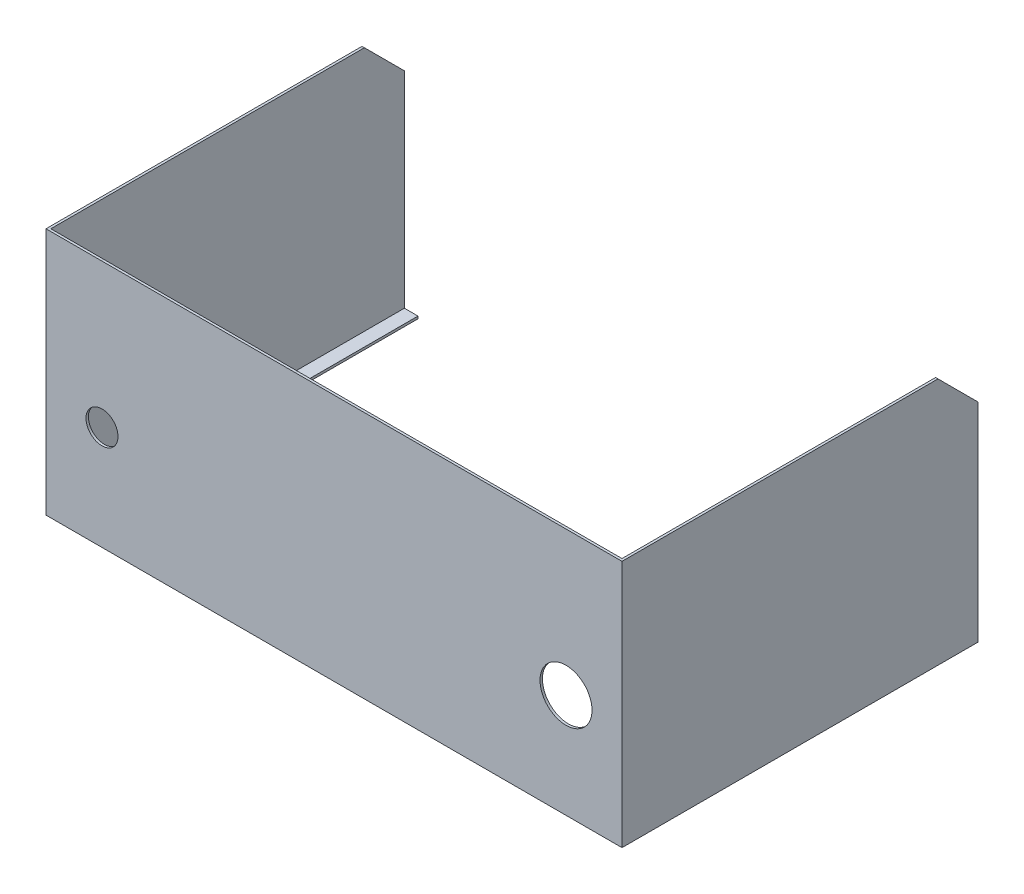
ISO-10303-21;
HEADER;
FILE_DESCRIPTION(('STEP AP214'),'2;1');
FILE_NAME('part.step','',(''),(''),'','','');
FILE_SCHEMA(('AUTOMOTIVE_DESIGN { 1 0 10303 214 1 1 1 1 }'));
ENDSEC;
DATA;
#1=APPLICATION_CONTEXT('core data for automotive mechanical design processes');
#2=APPLICATION_PROTOCOL_DEFINITION('international standard','automotive_design',2000,#1);
#3=PRODUCT_CONTEXT('',#1,'mechanical');
#4=PRODUCT('Part','Part','',(#3));
#5=PRODUCT_RELATED_PRODUCT_CATEGORY('part','',(#4));
#6=PRODUCT_DEFINITION_FORMATION('','',#4);
#7=PRODUCT_DEFINITION_CONTEXT('part definition',#1,'design');
#8=PRODUCT_DEFINITION('design','',#6,#7);
#9=PRODUCT_DEFINITION_SHAPE('','',#8);
#10=(LENGTH_UNIT() NAMED_UNIT(*) SI_UNIT(.MILLI.,.METRE.));
#11=(NAMED_UNIT(*) PLANE_ANGLE_UNIT() SI_UNIT($,.RADIAN.));
#12=(NAMED_UNIT(*) SI_UNIT($,.STERADIAN.) SOLID_ANGLE_UNIT());
#13=UNCERTAINTY_MEASURE_WITH_UNIT(LENGTH_MEASURE(1.E-05),#10,'distance_accuracy_value','');
#14=(GEOMETRIC_REPRESENTATION_CONTEXT(3) GLOBAL_UNCERTAINTY_ASSIGNED_CONTEXT((#13)) GLOBAL_UNIT_ASSIGNED_CONTEXT((#10,
#11,#12)) REPRESENTATION_CONTEXT('',''));
#15=CARTESIAN_POINT('',(0.,0.,0.));
#16=DIRECTION('',(0.,0.,1.));
#17=DIRECTION('',(1.,0.,0.));
#18=AXIS2_PLACEMENT_3D('',#15,#16,#17);
#19=CARTESIAN_POINT('',(0.,0.,0.));
#20=DIRECTION('',(0.,0.,-1.));
#21=DIRECTION('',(-1.,0.,0.));
#22=AXIS2_PLACEMENT_3D('',#19,#20,#21);
#23=PLANE('',#22);
#24=CARTESIAN_POINT('',(-290.,-25.,0.));
#25=DIRECTION('',(0.,0.,1.));
#26=DIRECTION('',(1.,0.,0.));
#27=AXIS2_PLACEMENT_3D('',#24,#25,#26);
#28=CIRCLE('',#27,20.);
#29=CARTESIAN_POINT('',(-270.,-25.,0.));
#30=VERTEX_POINT('',#29);
#31=EDGE_CURVE('E236',#30,#30,#28,.T.);
#32=ORIENTED_EDGE('',*,*,#31,.T.);
#33=EDGE_LOOP('',(#32));
#34=FACE_BOUND('',#33,.T.);
#35=CARTESIAN_POINT('',(290.,-24.9999999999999,0.));
#36=DIRECTION('',(0.,0.,1.));
#37=DIRECTION('',(1.,0.,0.));
#38=AXIS2_PLACEMENT_3D('',#35,#36,#37);
#39=CIRCLE('',#38,32.5);
#40=CARTESIAN_POINT('',(322.5,-24.9999999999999,0.));
#41=VERTEX_POINT('',#40);
#42=EDGE_CURVE('E228',#41,#41,#39,.T.);
#43=ORIENTED_EDGE('',*,*,#42,.T.);
#44=EDGE_LOOP('',(#43));
#45=FACE_BOUND('',#44,.T.);
#46=DIRECTION('',(0.,-1.,0.));
#47=VECTOR('',#46,1.);
#48=CARTESIAN_POINT('',(357.,-155.,0.));
#49=LINE('',#48,#47);
#50=CARTESIAN_POINT('',(357.,155.,0.));
#51=VERTEX_POINT('',#50);
#52=CARTESIAN_POINT('',(357.,-152.,0.));
#53=VERTEX_POINT('',#52);
#54=EDGE_CURVE('E217',#51,#53,#49,.T.);
#55=ORIENTED_EDGE('',*,*,#54,.T.);
#56=DIRECTION('',(1.,0.,0.));
#57=VECTOR('',#56,1.);
#58=CARTESIAN_POINT('',(0.,-152.,0.));
#59=LINE('',#58,#57);
#60=CARTESIAN_POINT('',(-357.,-152.,0.));
#61=VERTEX_POINT('',#60);
#62=EDGE_CURVE('E170',#61,#53,#59,.T.);
#63=ORIENTED_EDGE('',*,*,#62,.F.);
#64=DIRECTION('',(0.,1.,0.));
#65=VECTOR('',#64,1.);
#66=CARTESIAN_POINT('',(-357.,-155.,0.));
#67=LINE('',#66,#65);
#68=CARTESIAN_POINT('',(-357.,155.,0.));
#69=VERTEX_POINT('',#68);
#70=EDGE_CURVE('E187',#61,#69,#67,.T.);
#71=ORIENTED_EDGE('',*,*,#70,.T.);
#72=DIRECTION('',(-1.,0.,0.));
#73=VECTOR('',#72,1.);
#74=CARTESIAN_POINT('',(360.,155.,0.));
#75=LINE('',#74,#73);
#76=EDGE_CURVE('E242',#51,#69,#75,.T.);
#77=ORIENTED_EDGE('',*,*,#76,.F.);
#78=EDGE_LOOP('',(#55,#63,#71,#77));
#79=FACE_BOUND('',#78,.T.);
#80=ADVANCED_FACE('F35',(#34,#45,#79),#23,.T.);
#81=CARTESIAN_POINT('',(357.,0.,0.));
#82=DIRECTION('',(1.,0.,0.));
#83=DIRECTION('',(0.,0.,-1.));
#84=AXIS2_PLACEMENT_3D('',#81,#82,#83);
#85=PLANE('',#84);
#86=DIRECTION('',(0.,0.,-1.));
#87=VECTOR('',#86,1.);
#88=CARTESIAN_POINT('',(357.,-152.,0.));
#89=LINE('',#88,#87);
#90=CARTESIAN_POINT('',(357.,-152.,-442.));
#91=VERTEX_POINT('',#90);
#92=EDGE_CURVE('E168',#53,#91,#89,.T.);
#93=ORIENTED_EDGE('',*,*,#92,.F.);
#94=ORIENTED_EDGE('',*,*,#54,.F.);
#95=DIRECTION('',(0.,0.,1.));
#96=VECTOR('',#95,1.);
#97=CARTESIAN_POINT('',(357.,155.,0.));
#98=LINE('',#97,#96);
#99=CARTESIAN_POINT('',(357.,155.,-392.));
#100=VERTEX_POINT('',#99);
#101=EDGE_CURVE('E215',#100,#51,#98,.T.);
#102=ORIENTED_EDGE('',*,*,#101,.F.);
#103=DIRECTION('',(0.,0.707106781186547,0.707106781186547));
#104=VECTOR('',#103,1.);
#105=CARTESIAN_POINT('',(357.,155.,-392.));
#106=LINE('',#105,#104);
#107=CARTESIAN_POINT('',(357.,105.,-442.));
#108=VERTEX_POINT('',#107);
#109=EDGE_CURVE('E211',#108,#100,#106,.T.);
#110=ORIENTED_EDGE('',*,*,#109,.F.);
#111=DIRECTION('',(0.,1.,0.));
#112=VECTOR('',#111,1.);
#113=CARTESIAN_POINT('',(357.,-155.,-442.));
#114=LINE('',#113,#112);
#115=EDGE_CURVE('E209',#91,#108,#114,.T.);
#116=ORIENTED_EDGE('',*,*,#115,.F.);
#117=EDGE_LOOP('',(#93,#94,#102,#110,#116));
#118=FACE_BOUND('',#117,.T.);
#119=ADVANCED_FACE('F300',(#118),#85,.F.);
#120=CARTESIAN_POINT('',(-357.,0.,0.));
#121=DIRECTION('',(-1.,0.,0.));
#122=DIRECTION('',(0.,0.,1.));
#123=AXIS2_PLACEMENT_3D('',#120,#121,#122);
#124=PLANE('',#123);
#125=DIRECTION('',(0.,0.,1.));
#126=VECTOR('',#125,1.);
#127=CARTESIAN_POINT('',(-357.,-152.,0.));
#128=LINE('',#127,#126);
#129=CARTESIAN_POINT('',(-357.,-152.,-442.));
#130=VERTEX_POINT('',#129);
#131=EDGE_CURVE('E172',#130,#61,#128,.T.);
#132=ORIENTED_EDGE('',*,*,#131,.F.);
#133=DIRECTION('',(0.,-1.,0.));
#134=VECTOR('',#133,1.);
#135=CARTESIAN_POINT('',(-357.,105.,-442.));
#136=LINE('',#135,#134);
#137=CARTESIAN_POINT('',(-357.,105.,-442.));
#138=VERTEX_POINT('',#137);
#139=EDGE_CURVE('E184',#138,#130,#136,.T.);
#140=ORIENTED_EDGE('',*,*,#139,.F.);
#141=DIRECTION('',(0.,-0.707106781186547,-0.707106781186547));
#142=VECTOR('',#141,1.);
#143=CARTESIAN_POINT('',(-357.,155.,-392.));
#144=LINE('',#143,#142);
#145=CARTESIAN_POINT('',(-357.,155.,-392.));
#146=VERTEX_POINT('',#145);
#147=EDGE_CURVE('E193',#146,#138,#144,.T.);
#148=ORIENTED_EDGE('',*,*,#147,.F.);
#149=DIRECTION('',(0.,0.,-1.));
#150=VECTOR('',#149,1.);
#151=CARTESIAN_POINT('',(-357.,155.,0.));
#152=LINE('',#151,#150);
#153=EDGE_CURVE('E190',#69,#146,#152,.T.);
#154=ORIENTED_EDGE('',*,*,#153,.F.);
#155=ORIENTED_EDGE('',*,*,#70,.F.);
#156=EDGE_LOOP('',(#132,#140,#148,#154,#155));
#157=FACE_BOUND('',#156,.T.);
#158=ADVANCED_FACE('F290',(#157),#124,.F.);
#159=CARTESIAN_POINT('',(0.,0.,3.));
#160=DIRECTION('',(0.,0.,-1.));
#161=DIRECTION('',(-1.,0.,0.));
#162=AXIS2_PLACEMENT_3D('',#159,#160,#161);
#163=PLANE('',#162);
#164=DIRECTION('',(0.,-1.,0.));
#165=VECTOR('',#164,1.);
#166=CARTESIAN_POINT('',(-360.,155.,3.));
#167=LINE('',#166,#165);
#168=CARTESIAN_POINT('',(-360.,155.,3.));
#169=VERTEX_POINT('',#168);
#170=CARTESIAN_POINT('',(-360.,-155.,3.));
#171=VERTEX_POINT('',#170);
#172=EDGE_CURVE('E245',#169,#171,#167,.T.);
#173=ORIENTED_EDGE('',*,*,#172,.T.);
#174=DIRECTION('',(1.,0.,0.));
#175=VECTOR('',#174,1.);
#176=CARTESIAN_POINT('',(360.,-155.,3.));
#177=LINE('',#176,#175);
#178=CARTESIAN_POINT('',(360.,-155.,3.));
#179=VERTEX_POINT('',#178);
#180=EDGE_CURVE('E247',#171,#179,#177,.T.);
#181=ORIENTED_EDGE('',*,*,#180,.T.);
#182=DIRECTION('',(0.,1.,0.));
#183=VECTOR('',#182,1.);
#184=CARTESIAN_POINT('',(360.,155.,3.));
#185=LINE('',#184,#183);
#186=CARTESIAN_POINT('',(360.,155.,3.));
#187=VERTEX_POINT('',#186);
#188=EDGE_CURVE('E55',#179,#187,#185,.T.);
#189=ORIENTED_EDGE('',*,*,#188,.T.);
#190=DIRECTION('',(-1.,0.,0.));
#191=VECTOR('',#190,1.);
#192=CARTESIAN_POINT('',(360.,155.,3.));
#193=LINE('',#192,#191);
#194=EDGE_CURVE('E50',#187,#169,#193,.T.);
#195=ORIENTED_EDGE('',*,*,#194,.T.);
#196=EDGE_LOOP('',(#173,#181,#189,#195));
#197=FACE_BOUND('',#196,.T.);
#198=CARTESIAN_POINT('',(-290.,-25.,3.));
#199=DIRECTION('',(0.,0.,1.));
#200=DIRECTION('',(1.,0.,0.));
#201=AXIS2_PLACEMENT_3D('',#198,#199,#200);
#202=CIRCLE('',#201,20.);
#203=CARTESIAN_POINT('',(-270.,-25.,3.));
#204=VERTEX_POINT('',#203);
#205=EDGE_CURVE('E239',#204,#204,#202,.T.);
#206=ORIENTED_EDGE('',*,*,#205,.F.);
#207=EDGE_LOOP('',(#206));
#208=FACE_BOUND('',#207,.T.);
#209=CARTESIAN_POINT('',(290.,-24.9999999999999,3.));
#210=DIRECTION('',(0.,0.,1.));
#211=DIRECTION('',(1.,0.,0.));
#212=AXIS2_PLACEMENT_3D('',#209,#210,#211);
#213=CIRCLE('',#212,32.5);
#214=CARTESIAN_POINT('',(322.5,-24.9999999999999,3.));
#215=VERTEX_POINT('',#214);
#216=EDGE_CURVE('E233',#215,#215,#213,.T.);
#217=ORIENTED_EDGE('',*,*,#216,.F.);
#218=EDGE_LOOP('',(#217));
#219=FACE_BOUND('',#218,.T.);
#220=ADVANCED_FACE('F279',(#197,#208,#219),#163,.F.);
#221=CARTESIAN_POINT('',(-360.,155.,3.));
#222=DIRECTION('',(1.,0.,0.));
#223=DIRECTION('',(0.,0.,-1.));
#224=AXIS2_PLACEMENT_3D('',#221,#222,#223);
#225=PLANE('',#224);
#226=DIRECTION('',(0.,0.,-1.));
#227=VECTOR('',#226,1.);
#228=CARTESIAN_POINT('',(-360.,155.,3.));
#229=LINE('',#228,#227);
#230=CARTESIAN_POINT('',(-360.,155.,-392.));
#231=VERTEX_POINT('',#230);
#232=EDGE_CURVE('E251',#169,#231,#229,.T.);
#233=ORIENTED_EDGE('',*,*,#232,.T.);
#234=DIRECTION('',(0.,-0.707106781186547,-0.707106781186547));
#235=VECTOR('',#234,1.);
#236=CARTESIAN_POINT('',(-360.,155.,-392.));
#237=LINE('',#236,#235);
#238=CARTESIAN_POINT('',(-360.,105.,-442.));
#239=VERTEX_POINT('',#238);
#240=EDGE_CURVE('E188',#231,#239,#237,.T.);
#241=ORIENTED_EDGE('',*,*,#240,.T.);
#242=DIRECTION('',(0.,-1.,0.));
#243=VECTOR('',#242,1.);
#244=CARTESIAN_POINT('',(-360.,105.,-442.));
#245=LINE('',#244,#243);
#246=CARTESIAN_POINT('',(-360.,-155.,-442.));
#247=VERTEX_POINT('',#246);
#248=EDGE_CURVE('E179',#239,#247,#245,.T.);
#249=ORIENTED_EDGE('',*,*,#248,.T.);
#250=DIRECTION('',(0.,0.,-1.));
#251=VECTOR('',#250,1.);
#252=CARTESIAN_POINT('',(-360.,-155.,3.));
#253=LINE('',#252,#251);
#254=EDGE_CURVE('E11',#171,#247,#253,.T.);
#255=ORIENTED_EDGE('',*,*,#254,.F.);
#256=ORIENTED_EDGE('',*,*,#172,.F.);
#257=EDGE_LOOP('',(#233,#241,#249,#255,#256));
#258=FACE_BOUND('',#257,.T.);
#259=ADVANCED_FACE('F37',(#258),#225,.F.);
#260=CARTESIAN_POINT('',(360.,-155.,3.));
#261=DIRECTION('',(0.,1.,0.));
#262=DIRECTION('',(-1.,0.,0.));
#263=AXIS2_PLACEMENT_3D('',#260,#261,#262);
#264=PLANE('',#263);
#265=DIRECTION('',(0.,0.,1.));
#266=VECTOR('',#265,1.);
#267=CARTESIAN_POINT('',(340.,-155.,0.));
#268=LINE('',#267,#266);
#269=CARTESIAN_POINT('',(340.,-155.,-442.));
#270=VERTEX_POINT('',#269);
#271=CARTESIAN_POINT('',(340.,-155.,-17.));
#272=VERTEX_POINT('',#271);
#273=EDGE_CURVE('E160',#270,#272,#268,.T.);
#274=ORIENTED_EDGE('',*,*,#273,.F.);
#275=DIRECTION('',(1.,0.,0.));
#276=VECTOR('',#275,1.);
#277=CARTESIAN_POINT('',(357.,-155.,-442.));
#278=LINE('',#277,#276);
#279=CARTESIAN_POINT('',(360.,-155.,-442.));
#280=VERTEX_POINT('',#279);
#281=EDGE_CURVE('E220',#270,#280,#278,.T.);
#282=ORIENTED_EDGE('',*,*,#281,.T.);
#283=DIRECTION('',(0.,0.,-1.));
#284=VECTOR('',#283,1.);
#285=CARTESIAN_POINT('',(360.,-155.,3.));
#286=LINE('',#285,#284);
#287=EDGE_CURVE('E43',#179,#280,#286,.T.);
#288=ORIENTED_EDGE('',*,*,#287,.F.);
#289=ORIENTED_EDGE('',*,*,#180,.F.);
#290=ORIENTED_EDGE('',*,*,#254,.T.);
#291=DIRECTION('',(-1.,0.,0.));
#292=VECTOR('',#291,1.);
#293=CARTESIAN_POINT('',(-357.,-155.,-442.));
#294=LINE('',#293,#292);
#295=CARTESIAN_POINT('',(-340.,-155.,-442.));
#296=VERTEX_POINT('',#295);
#297=EDGE_CURVE('E196',#296,#247,#294,.T.);
#298=ORIENTED_EDGE('',*,*,#297,.F.);
#299=DIRECTION('',(0.,0.,1.));
#300=VECTOR('',#299,1.);
#301=CARTESIAN_POINT('',(-340.,-155.,0.));
#302=LINE('',#301,#300);
#303=CARTESIAN_POINT('',(-340.,-155.,-17.));
#304=VERTEX_POINT('',#303);
#305=EDGE_CURVE('E175',#296,#304,#302,.T.);
#306=ORIENTED_EDGE('',*,*,#305,.T.);
#307=DIRECTION('',(1.,0.,0.));
#308=VECTOR('',#307,1.);
#309=CARTESIAN_POINT('',(0.,-155.,-17.));
#310=LINE('',#309,#308);
#311=EDGE_CURVE('E140',#304,#272,#310,.T.);
#312=ORIENTED_EDGE('',*,*,#311,.T.);
#313=EDGE_LOOP('',(#274,#282,#288,#289,#290,#298,#306,#312));
#314=FACE_BOUND('',#313,.T.);
#315=ADVANCED_FACE('F262',(#314),#264,.F.);
#316=CARTESIAN_POINT('',(360.,155.,3.));
#317=DIRECTION('',(-1.,0.,0.));
#318=DIRECTION('',(0.,0.,1.));
#319=AXIS2_PLACEMENT_3D('',#316,#317,#318);
#320=PLANE('',#319);
#321=ORIENTED_EDGE('',*,*,#287,.T.);
#322=DIRECTION('',(0.,1.,0.));
#323=VECTOR('',#322,1.);
#324=CARTESIAN_POINT('',(360.,-155.,-442.));
#325=LINE('',#324,#323);
#326=CARTESIAN_POINT('',(360.,105.,-442.));
#327=VERTEX_POINT('',#326);
#328=EDGE_CURVE('E203',#280,#327,#325,.T.);
#329=ORIENTED_EDGE('',*,*,#328,.T.);
#330=DIRECTION('',(0.,0.707106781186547,0.707106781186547));
#331=VECTOR('',#330,1.);
#332=CARTESIAN_POINT('',(360.,155.,-392.));
#333=LINE('',#332,#331);
#334=CARTESIAN_POINT('',(360.,155.,-392.));
#335=VERTEX_POINT('',#334);
#336=EDGE_CURVE('E212',#327,#335,#333,.T.);
#337=ORIENTED_EDGE('',*,*,#336,.T.);
#338=DIRECTION('',(0.,0.,-1.));
#339=VECTOR('',#338,1.);
#340=CARTESIAN_POINT('',(360.,155.,3.));
#341=LINE('',#340,#339);
#342=EDGE_CURVE('E255',#187,#335,#341,.T.);
#343=ORIENTED_EDGE('',*,*,#342,.F.);
#344=ORIENTED_EDGE('',*,*,#188,.F.);
#345=EDGE_LOOP('',(#321,#329,#337,#343,#344));
#346=FACE_BOUND('',#345,.T.);
#347=ADVANCED_FACE('F258',(#346),#320,.F.);
#348=CARTESIAN_POINT('',(360.,155.,3.));
#349=DIRECTION('',(0.,-1.,0.));
#350=DIRECTION('',(1.,0.,0.));
#351=AXIS2_PLACEMENT_3D('',#348,#349,#350);
#352=PLANE('',#351);
#353=ORIENTED_EDGE('',*,*,#342,.T.);
#354=DIRECTION('',(1.,0.,0.));
#355=VECTOR('',#354,1.);
#356=CARTESIAN_POINT('',(357.,155.,-392.));
#357=LINE('',#356,#355);
#358=EDGE_CURVE('E225',#100,#335,#357,.T.);
#359=ORIENTED_EDGE('',*,*,#358,.F.);
#360=ORIENTED_EDGE('',*,*,#101,.T.);
#361=ORIENTED_EDGE('',*,*,#76,.T.);
#362=ORIENTED_EDGE('',*,*,#153,.T.);
#363=DIRECTION('',(-1.,0.,0.));
#364=VECTOR('',#363,1.);
#365=CARTESIAN_POINT('',(-357.,155.,-392.));
#366=LINE('',#365,#364);
#367=EDGE_CURVE('E204',#146,#231,#366,.T.);
#368=ORIENTED_EDGE('',*,*,#367,.T.);
#369=ORIENTED_EDGE('',*,*,#232,.F.);
#370=ORIENTED_EDGE('',*,*,#194,.F.);
#371=EDGE_LOOP('',(#353,#359,#360,#361,#362,#368,#369,#370));
#372=FACE_BOUND('',#371,.T.);
#373=ADVANCED_FACE('F274',(#372),#352,.F.);
#374=CARTESIAN_POINT('',(-290.,-25.,3.));
#375=DIRECTION('',(0.,0.,-1.));
#376=DIRECTION('',(-1.,0.,0.));
#377=AXIS2_PLACEMENT_3D('',#374,#375,#376);
#378=CYLINDRICAL_SURFACE('',#377,20.);
#379=ORIENTED_EDGE('',*,*,#205,.T.);
#380=EDGE_LOOP('',(#379));
#381=FACE_BOUND('',#380,.T.);
#382=ORIENTED_EDGE('',*,*,#31,.F.);
#383=EDGE_LOOP('',(#382));
#384=FACE_BOUND('',#383,.T.);
#385=ADVANCED_FACE('F325',(#381,#384),#378,.F.);
#386=CARTESIAN_POINT('',(290.,-24.9999999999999,3.));
#387=DIRECTION('',(0.,0.,-1.));
#388=DIRECTION('',(-1.,0.,0.));
#389=AXIS2_PLACEMENT_3D('',#386,#387,#388);
#390=CYLINDRICAL_SURFACE('',#389,32.5);
#391=ORIENTED_EDGE('',*,*,#216,.T.);
#392=EDGE_LOOP('',(#391));
#393=FACE_BOUND('',#392,.T.);
#394=ORIENTED_EDGE('',*,*,#42,.F.);
#395=EDGE_LOOP('',(#394));
#396=FACE_BOUND('',#395,.T.);
#397=ADVANCED_FACE('F347',(#393,#396),#390,.F.);
#398=CARTESIAN_POINT('',(357.,155.,-392.));
#399=DIRECTION('',(0.,0.707106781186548,-0.707106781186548));
#400=DIRECTION('',(0.,0.707106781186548,0.707106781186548));
#401=AXIS2_PLACEMENT_3D('',#398,#399,#400);
#402=PLANE('',#401);
#403=ORIENTED_EDGE('',*,*,#336,.F.);
#404=DIRECTION('',(1.,0.,0.));
#405=VECTOR('',#404,1.);
#406=CARTESIAN_POINT('',(357.,105.,-442.));
#407=LINE('',#406,#405);
#408=EDGE_CURVE('E229',#108,#327,#407,.T.);
#409=ORIENTED_EDGE('',*,*,#408,.F.);
#410=ORIENTED_EDGE('',*,*,#109,.T.);
#411=ORIENTED_EDGE('',*,*,#358,.T.);
#412=EDGE_LOOP('',(#403,#409,#410,#411));
#413=FACE_BOUND('',#412,.T.);
#414=ADVANCED_FACE('F272',(#413),#402,.T.);
#415=CARTESIAN_POINT('',(357.,-155.,-442.));
#416=DIRECTION('',(0.,0.,-1.));
#417=DIRECTION('',(-1.,0.,0.));
#418=AXIS2_PLACEMENT_3D('',#415,#416,#417);
#419=PLANE('',#418);
#420=ORIENTED_EDGE('',*,*,#328,.F.);
#421=ORIENTED_EDGE('',*,*,#281,.F.);
#422=DIRECTION('',(0.,-1.,0.));
#423=VECTOR('',#422,1.);
#424=CARTESIAN_POINT('',(340.,-152.,-442.));
#425=LINE('',#424,#423);
#426=CARTESIAN_POINT('',(340.,-152.,-442.));
#427=VERTEX_POINT('',#426);
#428=EDGE_CURVE('E180',#427,#270,#425,.T.);
#429=ORIENTED_EDGE('',*,*,#428,.F.);
#430=DIRECTION('',(-1.,0.,0.));
#431=VECTOR('',#430,1.);
#432=CARTESIAN_POINT('',(0.,-152.,-442.));
#433=LINE('',#432,#431);
#434=EDGE_CURVE('E166',#91,#427,#433,.T.);
#435=ORIENTED_EDGE('',*,*,#434,.F.);
#436=ORIENTED_EDGE('',*,*,#115,.T.);
#437=ORIENTED_EDGE('',*,*,#408,.T.);
#438=EDGE_LOOP('',(#420,#421,#429,#435,#436,#437));
#439=FACE_BOUND('',#438,.T.);
#440=ADVANCED_FACE('F265',(#439),#419,.T.);
#441=CARTESIAN_POINT('',(-357.,105.,-442.));
#442=DIRECTION('',(0.,0.,-1.));
#443=DIRECTION('',(-1.,0.,0.));
#444=AXIS2_PLACEMENT_3D('',#441,#442,#443);
#445=PLANE('',#444);
#446=ORIENTED_EDGE('',*,*,#248,.F.);
#447=DIRECTION('',(-1.,0.,0.));
#448=VECTOR('',#447,1.);
#449=CARTESIAN_POINT('',(-357.,105.,-442.));
#450=LINE('',#449,#448);
#451=EDGE_CURVE('E201',#138,#239,#450,.T.);
#452=ORIENTED_EDGE('',*,*,#451,.F.);
#453=ORIENTED_EDGE('',*,*,#139,.T.);
#454=DIRECTION('',(1.,0.,0.));
#455=VECTOR('',#454,1.);
#456=CARTESIAN_POINT('',(0.,-152.,-442.));
#457=LINE('',#456,#455);
#458=CARTESIAN_POINT('',(-340.,-152.,-442.));
#459=VERTEX_POINT('',#458);
#460=EDGE_CURVE('E146',#130,#459,#457,.T.);
#461=ORIENTED_EDGE('',*,*,#460,.T.);
#462=DIRECTION('',(0.,-1.,0.));
#463=VECTOR('',#462,1.);
#464=CARTESIAN_POINT('',(-340.,-152.,-442.));
#465=LINE('',#464,#463);
#466=EDGE_CURVE('E159',#459,#296,#465,.T.);
#467=ORIENTED_EDGE('',*,*,#466,.T.);
#468=ORIENTED_EDGE('',*,*,#297,.T.);
#469=EDGE_LOOP('',(#446,#452,#453,#461,#467,#468));
#470=FACE_BOUND('',#469,.T.);
#471=ADVANCED_FACE('F283',(#470),#445,.T.);
#472=CARTESIAN_POINT('',(-357.,155.,-392.));
#473=DIRECTION('',(0.,0.707106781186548,-0.707106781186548));
#474=DIRECTION('',(0.,0.707106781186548,0.707106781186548));
#475=AXIS2_PLACEMENT_3D('',#472,#473,#474);
#476=PLANE('',#475);
#477=ORIENTED_EDGE('',*,*,#240,.F.);
#478=ORIENTED_EDGE('',*,*,#367,.F.);
#479=ORIENTED_EDGE('',*,*,#147,.T.);
#480=ORIENTED_EDGE('',*,*,#451,.T.);
#481=EDGE_LOOP('',(#477,#478,#479,#480));
#482=FACE_BOUND('',#481,.T.);
#483=ADVANCED_FACE('F285',(#482),#476,.T.);
#484=CARTESIAN_POINT('',(-340.,-152.,0.));
#485=DIRECTION('',(1.,0.,0.));
#486=DIRECTION('',(0.,1.,0.));
#487=AXIS2_PLACEMENT_3D('',#484,#485,#486);
#488=PLANE('',#487);
#489=ORIENTED_EDGE('',*,*,#305,.F.);
#490=ORIENTED_EDGE('',*,*,#466,.F.);
#491=DIRECTION('',(0.,0.,1.));
#492=VECTOR('',#491,1.);
#493=CARTESIAN_POINT('',(-340.,-152.,0.));
#494=LINE('',#493,#492);
#495=CARTESIAN_POINT('',(-340.,-152.,-17.));
#496=VERTEX_POINT('',#495);
#497=EDGE_CURVE('E151',#459,#496,#494,.T.);
#498=ORIENTED_EDGE('',*,*,#497,.T.);
#499=DIRECTION('',(0.,-1.,0.));
#500=VECTOR('',#499,1.);
#501=CARTESIAN_POINT('',(-340.,-152.,-17.));
#502=LINE('',#501,#500);
#503=EDGE_CURVE('E135',#496,#304,#502,.T.);
#504=ORIENTED_EDGE('',*,*,#503,.T.);
#505=EDGE_LOOP('',(#489,#490,#498,#504));
#506=FACE_BOUND('',#505,.T.);
#507=ADVANCED_FACE('F157',(#506),#488,.T.);
#508=CARTESIAN_POINT('',(340.,-152.,0.));
#509=DIRECTION('',(1.,0.,0.));
#510=DIRECTION('',(0.,1.,0.));
#511=AXIS2_PLACEMENT_3D('',#508,#509,#510);
#512=PLANE('',#511);
#513=ORIENTED_EDGE('',*,*,#273,.T.);
#514=DIRECTION('',(0.,-1.,0.));
#515=VECTOR('',#514,1.);
#516=CARTESIAN_POINT('',(340.,-152.,-17.));
#517=LINE('',#516,#515);
#518=CARTESIAN_POINT('',(340.,-152.,-17.));
#519=VERTEX_POINT('',#518);
#520=EDGE_CURVE('E145',#519,#272,#517,.T.);
#521=ORIENTED_EDGE('',*,*,#520,.F.);
#522=DIRECTION('',(0.,0.,1.));
#523=VECTOR('',#522,1.);
#524=CARTESIAN_POINT('',(340.,-152.,0.));
#525=LINE('',#524,#523);
#526=EDGE_CURVE('E154',#427,#519,#525,.T.);
#527=ORIENTED_EDGE('',*,*,#526,.F.);
#528=ORIENTED_EDGE('',*,*,#428,.T.);
#529=EDGE_LOOP('',(#513,#521,#527,#528));
#530=FACE_BOUND('',#529,.T.);
#531=ADVANCED_FACE('F302',(#530),#512,.F.);
#532=CARTESIAN_POINT('',(0.,-152.,-17.));
#533=DIRECTION('',(0.,0.,-1.));
#534=DIRECTION('',(-1.,0.,0.));
#535=AXIS2_PLACEMENT_3D('',#532,#533,#534);
#536=PLANE('',#535);
#537=ORIENTED_EDGE('',*,*,#311,.F.);
#538=ORIENTED_EDGE('',*,*,#503,.F.);
#539=DIRECTION('',(1.,0.,0.));
#540=VECTOR('',#539,1.);
#541=CARTESIAN_POINT('',(0.,-152.,-17.));
#542=LINE('',#541,#540);
#543=EDGE_CURVE('E138',#496,#519,#542,.T.);
#544=ORIENTED_EDGE('',*,*,#543,.T.);
#545=ORIENTED_EDGE('',*,*,#520,.T.);
#546=EDGE_LOOP('',(#537,#538,#544,#545));
#547=FACE_BOUND('',#546,.T.);
#548=ADVANCED_FACE('F137',(#547),#536,.T.);
#549=CARTESIAN_POINT('',(0.,-152.,0.));
#550=DIRECTION('',(0.,-1.,0.));
#551=DIRECTION('',(1.,0.,0.));
#552=AXIS2_PLACEMENT_3D('',#549,#550,#551);
#553=PLANE('',#552);
#554=ORIENTED_EDGE('',*,*,#497,.F.);
#555=ORIENTED_EDGE('',*,*,#460,.F.);
#556=ORIENTED_EDGE('',*,*,#131,.T.);
#557=ORIENTED_EDGE('',*,*,#62,.T.);
#558=ORIENTED_EDGE('',*,*,#92,.T.);
#559=ORIENTED_EDGE('',*,*,#434,.T.);
#560=ORIENTED_EDGE('',*,*,#526,.T.);
#561=ORIENTED_EDGE('',*,*,#543,.F.);
#562=EDGE_LOOP('',(#554,#555,#556,#557,#558,#559,#560,#561));
#563=FACE_BOUND('',#562,.T.);
#564=ADVANCED_FACE('F150',(#563),#553,.F.);
#565=CLOSED_SHELL('',(#80,#119,#158,#220,#259,#315,#347,#373,#385,#397,#414,#440,#471,#483,#507,
#531,#548,#564));
#566=MANIFOLD_SOLID_BREP('B2',#565);
#567=ADVANCED_BREP_SHAPE_REPRESENTATION('',(#18,#566),#14);
#568=SHAPE_DEFINITION_REPRESENTATION(#9,#567);
ENDSEC;
END-ISO-10303-21;
